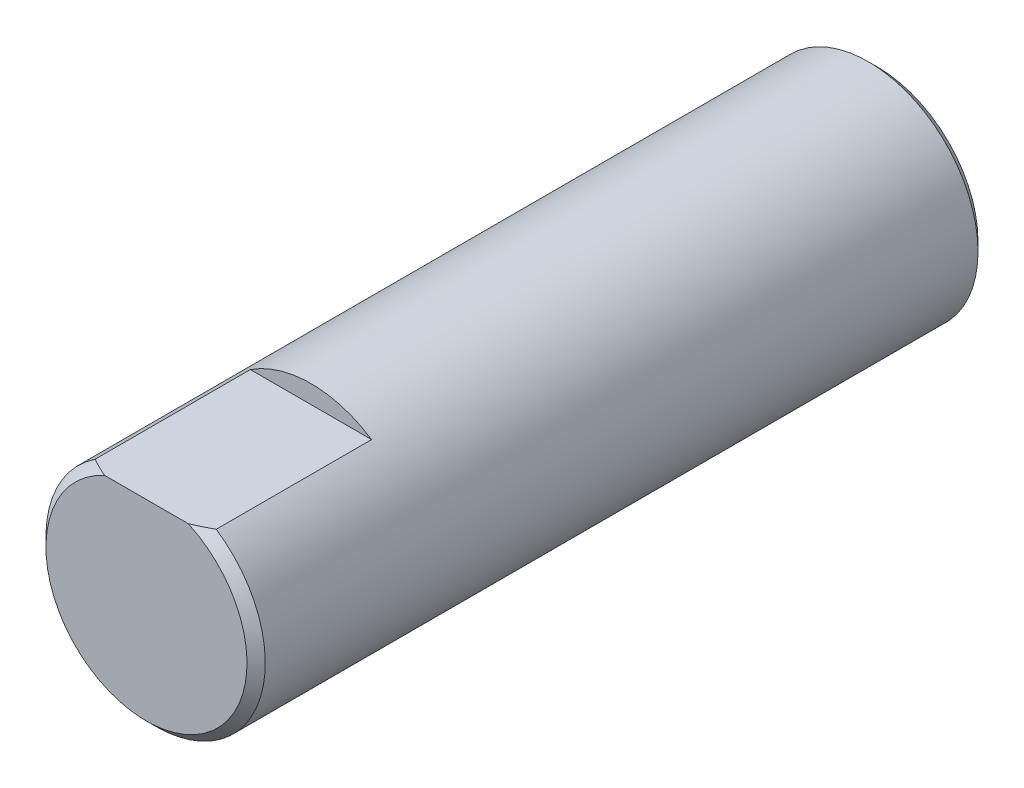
ISO-10303-21;
HEADER;
FILE_DESCRIPTION(('STEP AP214'),'2;1');
FILE_NAME('part.step','',(''),(''),'','','');
FILE_SCHEMA(('AUTOMOTIVE_DESIGN { 1 0 10303 214 1 1 1 1 }'));
ENDSEC;
DATA;
#1=APPLICATION_CONTEXT('core data for automotive mechanical design processes');
#2=APPLICATION_PROTOCOL_DEFINITION('international standard','automotive_design',2000,#1);
#3=PRODUCT_CONTEXT('',#1,'mechanical');
#4=PRODUCT('Part','Part','',(#3));
#5=PRODUCT_RELATED_PRODUCT_CATEGORY('part','',(#4));
#6=PRODUCT_DEFINITION_FORMATION('','',#4);
#7=PRODUCT_DEFINITION_CONTEXT('part definition',#1,'design');
#8=PRODUCT_DEFINITION('design','',#6,#7);
#9=PRODUCT_DEFINITION_SHAPE('','',#8);
#10=(LENGTH_UNIT() NAMED_UNIT(*) SI_UNIT(.MILLI.,.METRE.));
#11=(NAMED_UNIT(*) PLANE_ANGLE_UNIT() SI_UNIT($,.RADIAN.));
#12=(NAMED_UNIT(*) SI_UNIT($,.STERADIAN.) SOLID_ANGLE_UNIT());
#13=UNCERTAINTY_MEASURE_WITH_UNIT(LENGTH_MEASURE(1.E-05),#10,'distance_accuracy_value','');
#14=(GEOMETRIC_REPRESENTATION_CONTEXT(3) GLOBAL_UNCERTAINTY_ASSIGNED_CONTEXT((#13)) GLOBAL_UNIT_ASSIGNED_CONTEXT((#10,
#11,#12)) REPRESENTATION_CONTEXT('',''));
#15=CARTESIAN_POINT('',(0.,0.,0.));
#16=DIRECTION('',(0.,0.,1.));
#17=DIRECTION('',(1.,0.,0.));
#18=AXIS2_PLACEMENT_3D('',#15,#16,#17);
#19=CARTESIAN_POINT('',(0.,0.,20.));
#20=DIRECTION('',(0.,0.,-1.));
#21=DIRECTION('',(-1.,0.,0.));
#22=AXIS2_PLACEMENT_3D('',#19,#20,#21);
#23=CYLINDRICAL_SURFACE('',#22,6.);
#24=CARTESIAN_POINT('',(0.,0.,19.5));
#25=DIRECTION('',(0.,0.,1.));
#26=DIRECTION('',(1.,0.,0.));
#27=AXIS2_PLACEMENT_3D('',#24,#25,#26);
#28=CIRCLE('',#27,6.);
#29=CARTESIAN_POINT('',(3.3166247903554,5.,19.5));
#30=VERTEX_POINT('',#29);
#31=CARTESIAN_POINT('',(-3.31662479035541,4.99999999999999,19.5));
#32=VERTEX_POINT('',#31);
#33=EDGE_CURVE('E80',#30,#32,#28,.F.);
#34=ORIENTED_EDGE('',*,*,#33,.T.);
#35=DIRECTION('',(0.,0.,1.));
#36=VECTOR('',#35,1.);
#37=CARTESIAN_POINT('',(-3.31662479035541,5.,11.));
#38=LINE('',#37,#36);
#39=CARTESIAN_POINT('',(-3.31662479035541,5.,11.));
#40=VERTEX_POINT('',#39);
#41=EDGE_CURVE('E73',#40,#32,#38,.T.);
#42=ORIENTED_EDGE('',*,*,#41,.F.);
#43=CARTESIAN_POINT('',(0.,0.,11.));
#44=DIRECTION('',(0.,0.,1.));
#45=DIRECTION('',(1.,0.,0.));
#46=AXIS2_PLACEMENT_3D('',#43,#44,#45);
#47=CIRCLE('',#46,6.);
#48=CARTESIAN_POINT('',(3.3166247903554,5.,11.));
#49=VERTEX_POINT('',#48);
#50=EDGE_CURVE('E65',#49,#40,#47,.T.);
#51=ORIENTED_EDGE('',*,*,#50,.F.);
#52=DIRECTION('',(0.,0.,1.));
#53=VECTOR('',#52,1.);
#54=CARTESIAN_POINT('',(3.3166247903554,5.,11.));
#55=LINE('',#54,#53);
#56=EDGE_CURVE('E75',#49,#30,#55,.T.);
#57=ORIENTED_EDGE('',*,*,#56,.T.);
#58=EDGE_LOOP('',(#34,#42,#51,#57));
#59=FACE_BOUND('',#58,.T.);
#60=CARTESIAN_POINT('',(0.,0.,-19.5));
#61=DIRECTION('',(0.,0.,1.));
#62=DIRECTION('',(1.,0.,0.));
#63=AXIS2_PLACEMENT_3D('',#60,#61,#62);
#64=CIRCLE('',#63,6.);
#65=CARTESIAN_POINT('',(6.,0.,-19.5));
#66=VERTEX_POINT('',#65);
#67=EDGE_CURVE('E85',#66,#66,#64,.T.);
#68=ORIENTED_EDGE('',*,*,#67,.T.);
#69=EDGE_LOOP('',(#68));
#70=FACE_BOUND('',#69,.T.);
#71=ADVANCED_FACE('F30',(#59,#70),#23,.T.);
#72=CARTESIAN_POINT('',(0.,0.,20.));
#73=DIRECTION('',(0.,0.,1.));
#74=DIRECTION('',(1.,0.,0.));
#75=AXIS2_PLACEMENT_3D('',#72,#73,#74);
#76=PLANE('',#75);
#77=DIRECTION('',(1.,0.,0.));
#78=VECTOR('',#77,1.);
#79=CARTESIAN_POINT('',(-3.31662479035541,4.99999999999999,20.));
#80=LINE('',#79,#78);
#81=CARTESIAN_POINT('',(-2.2912878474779,5.,20.));
#82=VERTEX_POINT('',#81);
#83=CARTESIAN_POINT('',(2.2912878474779,5.,20.));
#84=VERTEX_POINT('',#83);
#85=EDGE_CURVE('E48',#82,#84,#80,.T.);
#86=ORIENTED_EDGE('',*,*,#85,.F.);
#87=CARTESIAN_POINT('',(0.,0.,20.));
#88=DIRECTION('',(0.,0.,1.));
#89=DIRECTION('',(1.,0.,0.));
#90=AXIS2_PLACEMENT_3D('',#87,#88,#89);
#91=CIRCLE('',#90,5.49999999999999);
#92=EDGE_CURVE('E90',#82,#84,#91,.T.);
#93=ORIENTED_EDGE('',*,*,#92,.T.);
#94=EDGE_LOOP('',(#86,#93));
#95=FACE_BOUND('',#94,.T.);
#96=ADVANCED_FACE('F94',(#95),#76,.T.);
#97=CARTESIAN_POINT('',(0.,0.,-20.));
#98=DIRECTION('',(0.,0.,1.));
#99=DIRECTION('',(1.,0.,0.));
#100=AXIS2_PLACEMENT_3D('',#97,#98,#99);
#101=PLANE('',#100);
#102=CARTESIAN_POINT('',(0.,0.,-20.));
#103=DIRECTION('',(0.,0.,1.));
#104=DIRECTION('',(1.,0.,0.));
#105=AXIS2_PLACEMENT_3D('',#102,#103,#104);
#106=CIRCLE('',#105,5.5);
#107=CARTESIAN_POINT('',(5.50000000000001,0.,-20.));
#108=VERTEX_POINT('',#107);
#109=EDGE_CURVE('E88',#108,#108,#106,.F.);
#110=ORIENTED_EDGE('',*,*,#109,.T.);
#111=EDGE_LOOP('',(#110));
#112=FACE_BOUND('',#111,.T.);
#113=ADVANCED_FACE('F103',(#112),#101,.F.);
#114=CARTESIAN_POINT('',(0.,0.,-19.5));
#115=DIRECTION('',(0.,0.,1.));
#116=DIRECTION('',(1.,0.,0.));
#117=AXIS2_PLACEMENT_3D('',#114,#115,#116);
#118=CONICAL_SURFACE('',#117,6.,0.785398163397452);
#119=ORIENTED_EDGE('',*,*,#109,.F.);
#120=EDGE_LOOP('',(#119));
#121=FACE_BOUND('',#120,.T.);
#122=ORIENTED_EDGE('',*,*,#67,.F.);
#123=EDGE_LOOP('',(#122));
#124=FACE_BOUND('',#123,.T.);
#125=ADVANCED_FACE('F98',(#121,#124),#118,.T.);
#126=CARTESIAN_POINT('',(0.,0.,20.));
#127=DIRECTION('',(0.,0.,-1.));
#128=DIRECTION('',(-1.,0.,0.));
#129=AXIS2_PLACEMENT_3D('',#126,#127,#128);
#130=CONICAL_SURFACE('',#129,5.49999999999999,0.785398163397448);
#131=CARTESIAN_POINT('',(-7.30806519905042,4.99999999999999,16.6451811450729));
#132=CARTESIAN_POINT('',(-7.17832735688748,5.,16.752250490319));
#133=CARTESIAN_POINT('',(-7.04814894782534,5.,16.8587870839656));
#134=CARTESIAN_POINT('',(-6.78677851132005,5.,17.0706177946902));
#135=CARTESIAN_POINT('',(-6.65558645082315,5.,17.1759118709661));
#136=CARTESIAN_POINT('',(-6.25998040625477,5.,17.4899110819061));
#137=CARTESIAN_POINT('',(-5.99385439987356,5.,17.6964694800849));
#138=CARTESIAN_POINT('',(-5.44957143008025,5.,18.1064264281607));
#139=CARTESIAN_POINT('',(-5.17127849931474,5.,18.309646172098));
#140=CARTESIAN_POINT('',(-4.74778519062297,5.,18.6057005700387));
#141=CARTESIAN_POINT('',(-4.60564078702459,5.,18.7029042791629));
#142=CARTESIAN_POINT('',(-4.31899779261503,5.,18.8937687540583));
#143=CARTESIAN_POINT('',(-4.17449932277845,4.99999999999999,18.9874297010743));
#144=CARTESIAN_POINT('',(-3.8410088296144,4.99999999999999,19.1966701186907));
#145=CARTESIAN_POINT('',(-3.6511274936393,5.,19.3108435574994));
#146=CARTESIAN_POINT('',(-3.26609667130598,5.,19.5298805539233));
#147=CARTESIAN_POINT('',(-3.07094880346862,5.,19.6347469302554));
#148=CARTESIAN_POINT('',(-2.67544917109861,5.,19.8317761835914));
#149=CARTESIAN_POINT('',(-2.47512700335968,5.,19.9239978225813));
#150=CARTESIAN_POINT('',(-2.06784585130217,5.,20.0924416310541));
#151=CARTESIAN_POINT('',(-1.86089066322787,5.,20.1686727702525));
#152=CARTESIAN_POINT('',(-1.5056220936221,5.,20.280044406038));
#153=CARTESIAN_POINT('',(-1.35901064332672,5.,20.320597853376));
#154=CARTESIAN_POINT('',(-1.06307155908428,5.,20.3902582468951));
#155=CARTESIAN_POINT('',(-0.91374430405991,5.,20.4193667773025));
#156=CARTESIAN_POINT('',(-0.613550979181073,5.,20.4646740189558));
#157=CARTESIAN_POINT('',(-0.46269049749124,5.,20.4809092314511));
#158=CARTESIAN_POINT('',(-0.160111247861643,5.,20.4997154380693));
#159=CARTESIAN_POINT('',(-0.00839251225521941,5.,20.5022869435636));
#160=CARTESIAN_POINT('',(0.294793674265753,5.,20.4936126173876));
#161=CARTESIAN_POINT('',(0.446260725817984,5.,20.4823530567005));
#162=CARTESIAN_POINT('',(0.747617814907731,5.,20.4466318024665));
#163=CARTESIAN_POINT('',(0.897507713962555,5.,20.4221689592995));
#164=CARTESIAN_POINT('',(1.19530965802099,5.,20.3611836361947));
#165=CARTESIAN_POINT('',(1.34321326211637,5.,20.3246205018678));
#166=CARTESIAN_POINT('',(1.63599450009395,5.,20.2410285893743));
#167=CARTESIAN_POINT('',(1.78087210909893,5.,20.1939997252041));
#168=CARTESIAN_POINT('',(2.09317129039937,5.,20.0818392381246));
#169=CARTESIAN_POINT('',(2.25996565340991,5.,20.0149732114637));
#170=CARTESIAN_POINT('',(2.58925284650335,5.,19.8713001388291));
#171=CARTESIAN_POINT('',(2.75174364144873,5.,19.7944884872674));
#172=CARTESIAN_POINT('',(3.07299812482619,5.,19.6328015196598));
#173=CARTESIAN_POINT('',(3.23175458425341,5.,19.547911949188));
#174=CARTESIAN_POINT('',(3.54566147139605,5.,19.3717996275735));
#175=CARTESIAN_POINT('',(3.70081241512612,5.,19.2805777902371));
#176=CARTESIAN_POINT('',(4.00899033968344,5.,19.0924250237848));
#177=CARTESIAN_POINT('',(4.16199684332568,5.,18.9954607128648));
#178=CARTESIAN_POINT('',(4.46528397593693,5.,18.7973452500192));
#179=CARTESIAN_POINT('',(4.61556435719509,5.,18.6961937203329));
#180=CARTESIAN_POINT('',(4.91361362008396,5.,18.4905795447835));
#181=CARTESIAN_POINT('',(5.06138486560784,5.,18.3861203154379));
#182=CARTESIAN_POINT('',(5.35489798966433,5.,18.1743870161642));
#183=CARTESIAN_POINT('',(5.50063981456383,5.,18.0671128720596));
#184=CARTESIAN_POINT('',(5.78766649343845,5.,17.8522420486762));
#185=CARTESIAN_POINT('',(5.92898379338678,5.,17.7446886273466));
#186=CARTESIAN_POINT('',(6.21015977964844,5.,17.5276667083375));
#187=CARTESIAN_POINT('',(6.35001832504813,5.,17.418198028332));
#188=CARTESIAN_POINT('',(6.62686314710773,5.,17.1989007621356));
#189=CARTESIAN_POINT('',(6.76386398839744,5.,17.089090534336));
#190=CARTESIAN_POINT('',(7.03675773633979,5.,16.8681057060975));
#191=CARTESIAN_POINT('',(7.17265066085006,5.,16.7569311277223));
#192=CARTESIAN_POINT('',(7.30806519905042,5.,16.6451811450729));
#193=B_SPLINE_CURVE_WITH_KNOTS('',3,(#131,#132,#133,#134,#135,#136,#137,#138,#139,#140,#141,
#142,#143,#144,#145,#146,#147,#148,#149,#150,#151,#152,#153,#154,#155,#156,#157,#158,#159,#160,
#161,#162,#163,#164,#165,#166,#167,#168,#169,#170,#171,#172,#173,#174,#175,#176,#177,#178,#179,
#180,#181,#182,#183,#184,#185,#186,#187,#188,#189,#190,#191,#192),.UNSPECIFIED.,.F.,.F.,(4,2,2,
2,2,2,2,2,2,2,2,2,2,2,2,2,2,2,2,2,2,2,2,2,2,2,2,2,2,2,4),(0.,0.504639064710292,1.00929465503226,
2.01984459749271,3.05338555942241,3.56994956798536,4.08648711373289,4.75097666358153,
5.4152642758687,6.07635187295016,6.73706764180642,7.19303269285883,7.64893460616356,
8.10353917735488,8.55812673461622,9.01316589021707,9.46824467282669,9.92486821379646,
10.3814955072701,10.9201780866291,11.4591110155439,11.9990132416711,12.5388377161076,
13.0821861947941,13.625583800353,14.1684373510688,14.7113052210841,15.2440573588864,
15.7768604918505,16.3035842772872,16.830299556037),.UNSPECIFIED.);
#194=EDGE_CURVE('E11',#32,#82,#193,.T.);
#195=ORIENTED_EDGE('',*,*,#194,.F.);
#196=ORIENTED_EDGE('',*,*,#33,.F.);
#197=EDGE_CURVE('E33',#84,#30,#193,.T.);
#198=ORIENTED_EDGE('',*,*,#197,.F.);
#199=ORIENTED_EDGE('',*,*,#92,.F.);
#200=EDGE_LOOP('',(#195,#196,#198,#199));
#201=FACE_BOUND('',#200,.T.);
#202=ADVANCED_FACE('F96',(#201),#130,.T.);
#203=CARTESIAN_POINT('',(-3.31662479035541,5.,11.));
#204=DIRECTION('',(0.,-1.,0.));
#205=DIRECTION('',(0.,0.,-1.));
#206=AXIS2_PLACEMENT_3D('',#203,#204,#205);
#207=PLANE('',#206);
#208=ORIENTED_EDGE('',*,*,#194,.T.);
#209=ORIENTED_EDGE('',*,*,#85,.T.);
#210=ORIENTED_EDGE('',*,*,#197,.T.);
#211=ORIENTED_EDGE('',*,*,#56,.F.);
#212=DIRECTION('',(1.,0.,0.));
#213=VECTOR('',#212,1.);
#214=CARTESIAN_POINT('',(-3.31662479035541,5.,11.));
#215=LINE('',#214,#213);
#216=EDGE_CURVE('E68',#40,#49,#215,.T.);
#217=ORIENTED_EDGE('',*,*,#216,.F.);
#218=ORIENTED_EDGE('',*,*,#41,.T.);
#219=EDGE_LOOP('',(#208,#209,#210,#211,#217,#218));
#220=FACE_BOUND('',#219,.T.);
#221=ADVANCED_FACE('F72',(#220),#207,.F.);
#222=CARTESIAN_POINT('',(0.,0.,11.));
#223=DIRECTION('',(0.,0.,1.));
#224=DIRECTION('',(1.,0.,0.));
#225=AXIS2_PLACEMENT_3D('',#222,#223,#224);
#226=PLANE('',#225);
#227=ORIENTED_EDGE('',*,*,#50,.T.);
#228=ORIENTED_EDGE('',*,*,#216,.T.);
#229=EDGE_LOOP('',(#227,#228));
#230=FACE_BOUND('',#229,.T.);
#231=ADVANCED_FACE('F67',(#230),#226,.T.);
#232=CLOSED_SHELL('',(#71,#96,#113,#125,#202,#221,#231));
#233=MANIFOLD_SOLID_BREP('B2',#232);
#234=ADVANCED_BREP_SHAPE_REPRESENTATION('',(#18,#233),#14);
#235=SHAPE_DEFINITION_REPRESENTATION(#9,#234);
ENDSEC;
END-ISO-10303-21;
